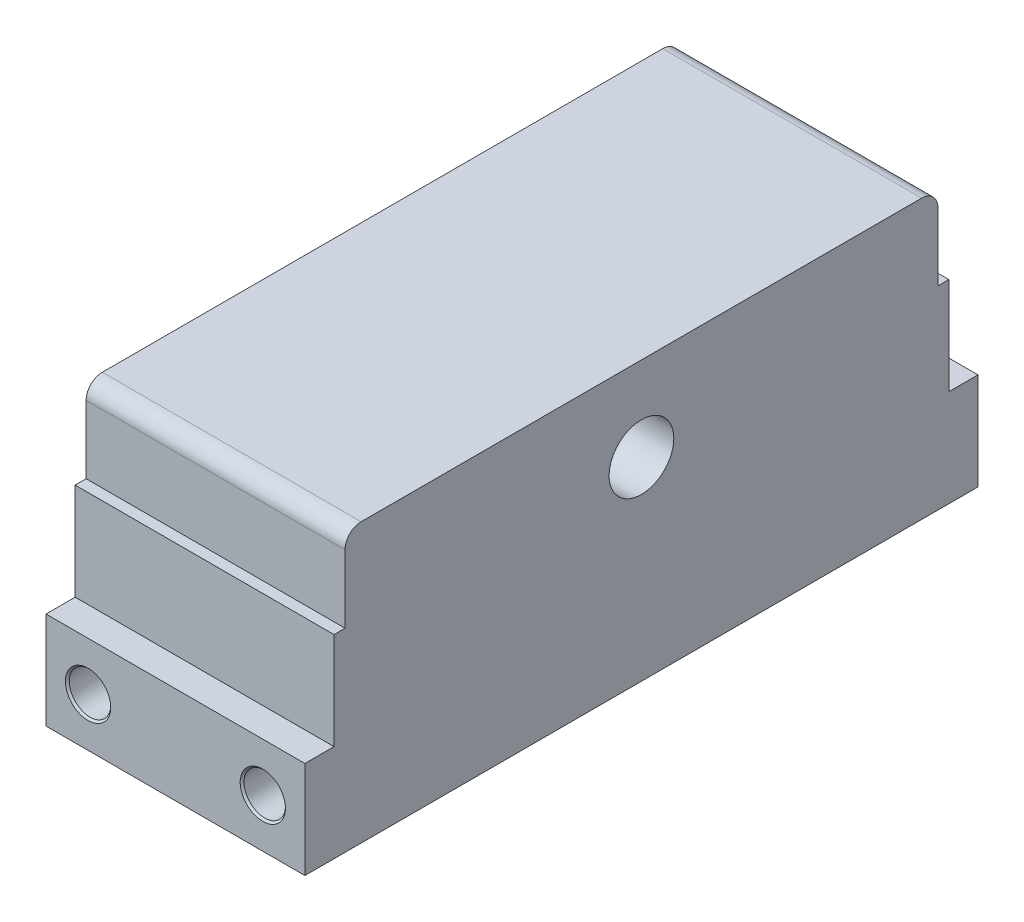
from build123d import *

# Parameters (mm, degrees)
SCHIZZO1_R                     = 5
ESTRUSIONE_ESTRUSIONE1_DEPTH   = 40
FORO_PER_VITE_M6_1_D           = 6.4
FORO_PER_VITE_M6_1_DEPTH       = 30
FORO_PER_VITE_M6_1_CSINK_D     = 7
FORO_PER_VITE_M6_1_CSINK_ANGLE = 90
FORO_PER_VITE_M6_1_TIP         = 1.922753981
FORO_PER_VITE_M6_2_D           = 6.4
FORO_PER_VITE_M6_2_DEPTH       = 30
FORO_PER_VITE_M6_2_CSINK_D     = 7
FORO_PER_VITE_M6_2_CSINK_ANGLE = 90
FORO_PER_VITE_M6_2_TIP         = 1.922753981
FORO_PER_VITE_M6_5_D           = 6.4
FORO_PER_VITE_M6_5_DEPTH       = 30
FORO_PER_VITE_M6_5_CSINK_D     = 7
FORO_PER_VITE_M6_5_CSINK_ANGLE = 90
FORO_PER_VITE_M6_5_TIP         = 1.922753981


with BuildPart() as part:
    # Schizzo1 → Estrusione-Estrusione1 (new body)
    with BuildSketch(Plane(origin=(0, 0, 0), x_dir=(0, 0, -1), z_dir=(1, 0, 0))):
        with BuildLine():
            Line((-45.8, 10.5), (-45.8, 0))
            Line((-45.8, 0), (-47.5, 0))
            Line((-47.5, 0), (-47.5, -15))
            Line((-47.5, -15), (-52, -15))
            Line((-52, -15), (-52, -30))
            Line((-52, -30), (52, -30))
            Line((52, -30), (52, -15))
            Line((52, -15), (47.5, -15))
            Line((47.5, -15), (47.5, 0))
            Line((47.5, 0), (45.8, 0))
            Line((45.8, 0), (45.8, 10.5))
            ThreePointArc((45.8, 10.5), (45.067766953, 12.267766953), (43.3, 13))
            Line((43.3, 13), (0, 13))
            Line((0, 13), (-43.3, 13))
            ThreePointArc((-43.3, 13), (-45.067766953, 12.267766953), (-45.8, 10.5))
        make_face()
        Circle(SCHIZZO1_R, mode=Mode.SUBTRACT)
    extrude(amount=ESTRUSIONE_ESTRUSIONE1_DEPTH)

    # Foro per Vite M6-1
    with Locations(Plane(origin=(6.5, -22.5, 52), x_dir=(0, 1, 0), z_dir=(0, 0, 1))):
        with Locations((0, 0), (0, -27)):
            CounterSinkHole(FORO_PER_VITE_M6_1_D / 2, FORO_PER_VITE_M6_1_CSINK_D / 2, depth=FORO_PER_VITE_M6_1_DEPTH, counter_sink_angle=FORO_PER_VITE_M6_1_CSINK_ANGLE)
            with Locations((0, 0, -(FORO_PER_VITE_M6_1_DEPTH + FORO_PER_VITE_M6_1_TIP / 2))):  # 118° drill point
                Cone(0, FORO_PER_VITE_M6_1_D / 2, FORO_PER_VITE_M6_1_TIP, mode=Mode.SUBTRACT)

    # Foro per Vite M6-2
    with Locations(Plane(origin=(0, 0, -52), x_dir=(-1, 0, 0), z_dir=(0, 0, -1))):
        with Locations((-33.5, -22.5)):
            CounterSinkHole(FORO_PER_VITE_M6_2_D / 2, FORO_PER_VITE_M6_2_CSINK_D / 2, depth=FORO_PER_VITE_M6_2_DEPTH, counter_sink_angle=FORO_PER_VITE_M6_2_CSINK_ANGLE)
            with Locations((0, 0, -(FORO_PER_VITE_M6_2_DEPTH + FORO_PER_VITE_M6_2_TIP / 2))):  # 118° drill point
                Cone(0, FORO_PER_VITE_M6_2_D / 2, FORO_PER_VITE_M6_2_TIP, mode=Mode.SUBTRACT)

    # Foro per Vite M6-5
    with Locations(Plane(origin=(0, 0, -52), x_dir=(-1, 0, 0), z_dir=(0, 0, -1))):
        with Locations((-6.5, -22.5)):
            CounterSinkHole(FORO_PER_VITE_M6_5_D / 2, FORO_PER_VITE_M6_5_CSINK_D / 2, depth=FORO_PER_VITE_M6_5_DEPTH, counter_sink_angle=FORO_PER_VITE_M6_5_CSINK_ANGLE)
            with Locations((0, 0, -(FORO_PER_VITE_M6_5_DEPTH + FORO_PER_VITE_M6_5_TIP / 2))):  # 118° drill point
                Cone(0, FORO_PER_VITE_M6_5_D / 2, FORO_PER_VITE_M6_5_TIP, mode=Mode.SUBTRACT)


solid = part.part
